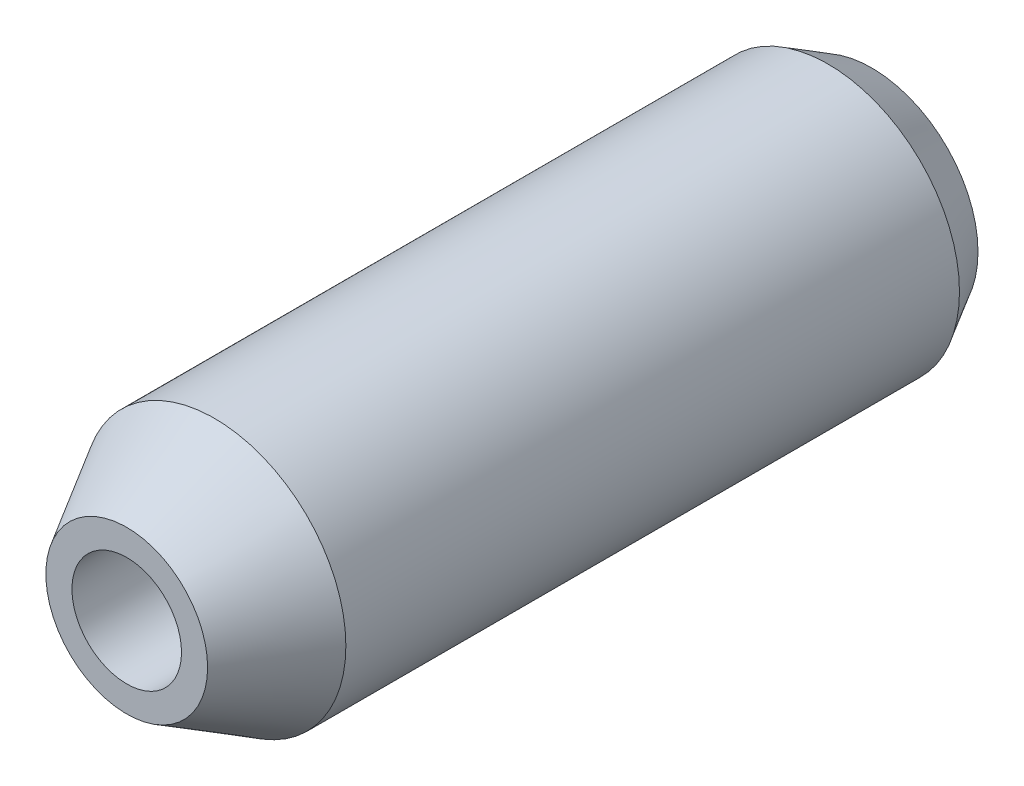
ISO-10303-21;
HEADER;
FILE_DESCRIPTION(('STEP AP214'),'2;1');
FILE_NAME('part.step','',(''),(''),'','','');
FILE_SCHEMA(('AUTOMOTIVE_DESIGN { 1 0 10303 214 1 1 1 1 }'));
ENDSEC;
DATA;
#1=APPLICATION_CONTEXT('core data for automotive mechanical design processes');
#2=APPLICATION_PROTOCOL_DEFINITION('international standard','automotive_design',2000,#1);
#3=PRODUCT_CONTEXT('',#1,'mechanical');
#4=PRODUCT('Part','Part','',(#3));
#5=PRODUCT_RELATED_PRODUCT_CATEGORY('part','',(#4));
#6=PRODUCT_DEFINITION_FORMATION('','',#4);
#7=PRODUCT_DEFINITION_CONTEXT('part definition',#1,'design');
#8=PRODUCT_DEFINITION('design','',#6,#7);
#9=PRODUCT_DEFINITION_SHAPE('','',#8);
#10=(LENGTH_UNIT() NAMED_UNIT(*) SI_UNIT(.MILLI.,.METRE.));
#11=(NAMED_UNIT(*) PLANE_ANGLE_UNIT() SI_UNIT($,.RADIAN.));
#12=(NAMED_UNIT(*) SI_UNIT($,.STERADIAN.) SOLID_ANGLE_UNIT());
#13=UNCERTAINTY_MEASURE_WITH_UNIT(LENGTH_MEASURE(1.E-05),#10,'distance_accuracy_value','');
#14=(GEOMETRIC_REPRESENTATION_CONTEXT(3) GLOBAL_UNCERTAINTY_ASSIGNED_CONTEXT((#13)) GLOBAL_UNIT_ASSIGNED_CONTEXT((#10,
#11,#12)) REPRESENTATION_CONTEXT('',''));
#15=CARTESIAN_POINT('',(0.,0.,0.));
#16=DIRECTION('',(0.,0.,1.));
#17=DIRECTION('',(1.,0.,0.));
#18=AXIS2_PLACEMENT_3D('',#15,#16,#17);
#19=CARTESIAN_POINT('',(0.,0.,0.));
#20=DIRECTION('',(0.,0.,1.));
#21=DIRECTION('',(1.,0.,0.));
#22=AXIS2_PLACEMENT_3D('',#19,#20,#21);
#23=PLANE('',#22);
#24=CARTESIAN_POINT('',(0.,0.,0.));
#25=DIRECTION('',(0.,0.,1.));
#26=DIRECTION('',(1.,0.,0.));
#27=AXIS2_PLACEMENT_3D('',#24,#25,#26);
#28=CIRCLE('',#27,4.84529946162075);
#29=CARTESIAN_POINT('',(4.84529946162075,0.,0.));
#30=VERTEX_POINT('',#29);
#31=EDGE_CURVE('E8',#30,#30,#28,.T.);
#32=ORIENTED_EDGE('',*,*,#31,.F.);
#33=EDGE_LOOP('',(#32));
#34=FACE_BOUND('',#33,.T.);
#35=ADVANCED_FACE('F13',(#34),#23,.F.);
#36=CARTESIAN_POINT('',(0.,0.,2.));
#37=DIRECTION('',(0.,0.,1.));
#38=DIRECTION('',(1.,0.,0.));
#39=AXIS2_PLACEMENT_3D('',#36,#37,#38);
#40=CONICAL_SURFACE('',#39,6.,0.523598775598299);
#41=ORIENTED_EDGE('',*,*,#31,.T.);
#42=EDGE_LOOP('',(#41));
#43=FACE_BOUND('',#42,.T.);
#44=CARTESIAN_POINT('',(0.,0.,2.));
#45=DIRECTION('',(0.,0.,1.));
#46=DIRECTION('',(1.,0.,0.));
#47=AXIS2_PLACEMENT_3D('',#44,#45,#46);
#48=CIRCLE('',#47,6.);
#49=CARTESIAN_POINT('',(6.,0.,2.));
#50=VERTEX_POINT('',#49);
#51=EDGE_CURVE('E19',#50,#50,#48,.T.);
#52=ORIENTED_EDGE('',*,*,#51,.F.);
#53=EDGE_LOOP('',(#52));
#54=FACE_BOUND('',#53,.T.);
#55=ADVANCED_FACE('F61',(#43,#54),#40,.T.);
#56=CARTESIAN_POINT('',(0.,0.,50.));
#57=DIRECTION('',(0.,0.,1.));
#58=DIRECTION('',(1.,0.,0.));
#59=AXIS2_PLACEMENT_3D('',#56,#57,#58);
#60=CYLINDRICAL_SURFACE('',#59,6.);
#61=CARTESIAN_POINT('',(0.,0.,30.));
#62=DIRECTION('',(0.,0.,1.));
#63=DIRECTION('',(1.,0.,0.));
#64=AXIS2_PLACEMENT_3D('',#61,#62,#63);
#65=CIRCLE('',#64,6.);
#66=CARTESIAN_POINT('',(6.,0.,30.));
#67=VERTEX_POINT('',#66);
#68=EDGE_CURVE('E23',#67,#67,#65,.T.);
#69=ORIENTED_EDGE('',*,*,#68,.F.);
#70=EDGE_LOOP('',(#69));
#71=FACE_BOUND('',#70,.T.);
#72=ORIENTED_EDGE('',*,*,#51,.T.);
#73=EDGE_LOOP('',(#72));
#74=FACE_BOUND('',#73,.T.);
#75=ADVANCED_FACE('F56',(#71,#74),#60,.T.);
#76=CARTESIAN_POINT('',(0.,0.,30.));
#77=DIRECTION('',(0.,0.,-1.));
#78=DIRECTION('',(-1.,0.,0.));
#79=AXIS2_PLACEMENT_3D('',#76,#77,#78);
#80=CONICAL_SURFACE('',#79,6.,0.523598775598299);
#81=CARTESIAN_POINT('',(0.,0.,34.));
#82=DIRECTION('',(0.,0.,1.));
#83=DIRECTION('',(1.,0.,0.));
#84=AXIS2_PLACEMENT_3D('',#81,#82,#83);
#85=CIRCLE('',#84,3.69059892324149);
#86=CARTESIAN_POINT('',(3.69059892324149,0.,34.));
#87=VERTEX_POINT('',#86);
#88=EDGE_CURVE('E27',#87,#87,#85,.T.);
#89=ORIENTED_EDGE('',*,*,#88,.F.);
#90=EDGE_LOOP('',(#89));
#91=FACE_BOUND('',#90,.T.);
#92=ORIENTED_EDGE('',*,*,#68,.T.);
#93=EDGE_LOOP('',(#92));
#94=FACE_BOUND('',#93,.T.);
#95=ADVANCED_FACE('F50',(#91,#94),#80,.T.);
#96=CARTESIAN_POINT('',(3.69059892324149,0.,34.));
#97=DIRECTION('',(0.,0.,-1.));
#98=DIRECTION('',(-1.,0.,0.));
#99=AXIS2_PLACEMENT_3D('',#96,#97,#98);
#100=PLANE('',#99);
#101=CARTESIAN_POINT('',(0.,0.,34.));
#102=DIRECTION('',(0.,0.,1.));
#103=DIRECTION('',(1.,0.,0.));
#104=AXIS2_PLACEMENT_3D('',#101,#102,#103);
#105=CIRCLE('',#104,2.5);
#106=CARTESIAN_POINT('',(2.5,0.,34.));
#107=VERTEX_POINT('',#106);
#108=EDGE_CURVE('E32',#107,#107,#105,.T.);
#109=ORIENTED_EDGE('',*,*,#108,.F.);
#110=EDGE_LOOP('',(#109));
#111=FACE_BOUND('',#110,.T.);
#112=ORIENTED_EDGE('',*,*,#88,.T.);
#113=EDGE_LOOP('',(#112));
#114=FACE_BOUND('',#113,.T.);
#115=ADVANCED_FACE('F44',(#111,#114),#100,.F.);
#116=CARTESIAN_POINT('',(0.,0.,50.));
#117=DIRECTION('',(0.,0.,1.));
#118=DIRECTION('',(1.,0.,0.));
#119=AXIS2_PLACEMENT_3D('',#116,#117,#118);
#120=CYLINDRICAL_SURFACE('',#119,2.5);
#121=CARTESIAN_POINT('',(0.,0.,24.));
#122=DIRECTION('',(0.,0.,1.));
#123=DIRECTION('',(1.,0.,0.));
#124=AXIS2_PLACEMENT_3D('',#121,#122,#123);
#125=CIRCLE('',#124,2.5);
#126=CARTESIAN_POINT('',(2.5,0.,24.));
#127=VERTEX_POINT('',#126);
#128=EDGE_CURVE('E35',#127,#127,#125,.T.);
#129=ORIENTED_EDGE('',*,*,#128,.F.);
#130=EDGE_LOOP('',(#129));
#131=FACE_BOUND('',#130,.T.);
#132=ORIENTED_EDGE('',*,*,#108,.T.);
#133=EDGE_LOOP('',(#132));
#134=FACE_BOUND('',#133,.T.);
#135=ADVANCED_FACE('F41',(#131,#134),#120,.F.);
#136=CARTESIAN_POINT('',(0.,0.,24.));
#137=DIRECTION('',(0.,0.,1.));
#138=DIRECTION('',(1.,0.,0.));
#139=AXIS2_PLACEMENT_3D('',#136,#137,#138);
#140=PLANE('',#139);
#141=ORIENTED_EDGE('',*,*,#128,.T.);
#142=EDGE_LOOP('',(#141));
#143=FACE_BOUND('',#142,.T.);
#144=ADVANCED_FACE('F39',(#143),#140,.T.);
#145=CLOSED_SHELL('',(#35,#55,#75,#95,#115,#135,#144));
#146=MANIFOLD_SOLID_BREP('B1',#145);
#147=ADVANCED_BREP_SHAPE_REPRESENTATION('',(#18,#146),#14);
#148=SHAPE_DEFINITION_REPRESENTATION(#9,#147);
ENDSEC;
END-ISO-10303-21;
